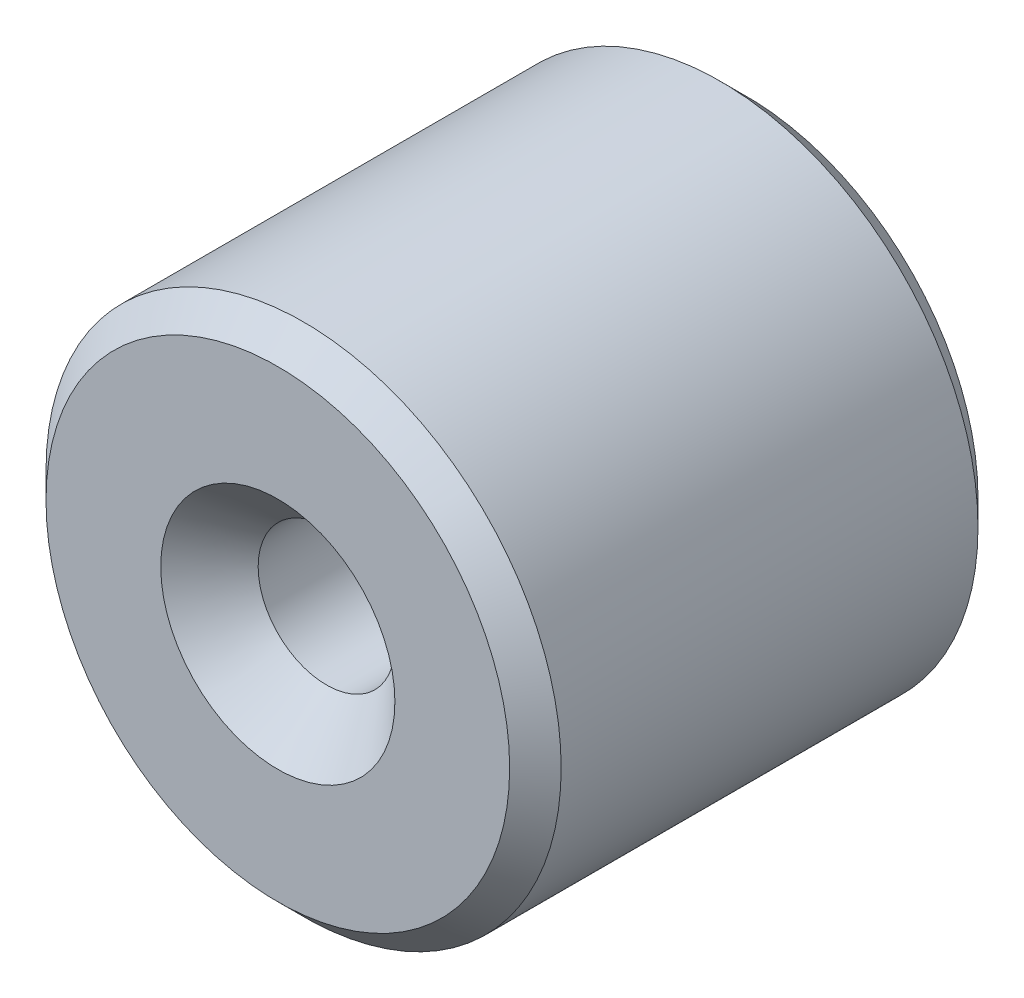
ISO-10303-21;
HEADER;
FILE_DESCRIPTION(('STEP AP214'),'2;1');
FILE_NAME('part.step','',(''),(''),'','','');
FILE_SCHEMA(('AUTOMOTIVE_DESIGN { 1 0 10303 214 1 1 1 1 }'));
ENDSEC;
DATA;
#1=APPLICATION_CONTEXT('core data for automotive mechanical design processes');
#2=APPLICATION_PROTOCOL_DEFINITION('international standard','automotive_design',2000,#1);
#3=PRODUCT_CONTEXT('',#1,'mechanical');
#4=PRODUCT('Part','Part','',(#3));
#5=PRODUCT_RELATED_PRODUCT_CATEGORY('part','',(#4));
#6=PRODUCT_DEFINITION_FORMATION('','',#4);
#7=PRODUCT_DEFINITION_CONTEXT('part definition',#1,'design');
#8=PRODUCT_DEFINITION('design','',#6,#7);
#9=PRODUCT_DEFINITION_SHAPE('','',#8);
#10=(LENGTH_UNIT() NAMED_UNIT(*) SI_UNIT(.MILLI.,.METRE.));
#11=(NAMED_UNIT(*) PLANE_ANGLE_UNIT() SI_UNIT($,.RADIAN.));
#12=(NAMED_UNIT(*) SI_UNIT($,.STERADIAN.) SOLID_ANGLE_UNIT());
#13=UNCERTAINTY_MEASURE_WITH_UNIT(LENGTH_MEASURE(1.E-05),#10,'distance_accuracy_value','');
#14=(GEOMETRIC_REPRESENTATION_CONTEXT(3) GLOBAL_UNCERTAINTY_ASSIGNED_CONTEXT((#13)) GLOBAL_UNIT_ASSIGNED_CONTEXT((#10,
#11,#12)) REPRESENTATION_CONTEXT('',''));
#15=CARTESIAN_POINT('',(0.,0.,0.));
#16=DIRECTION('',(0.,0.,1.));
#17=DIRECTION('',(1.,0.,0.));
#18=AXIS2_PLACEMENT_3D('',#15,#16,#17);
#19=CARTESIAN_POINT('',(0.,9.9,0.));
#20=DIRECTION('',(0.,0.,1.));
#21=DIRECTION('',(1.,0.,0.));
#22=AXIS2_PLACEMENT_3D('',#19,#20,#21);
#23=PLANE('',#22);
#24=CARTESIAN_POINT('',(0.,0.,0.));
#25=DIRECTION('',(0.,0.,-1.));
#26=DIRECTION('',(-1.,0.,0.));
#27=AXIS2_PLACEMENT_3D('',#24,#25,#26);
#28=CIRCLE('',#27,9.9);
#29=CARTESIAN_POINT('',(-9.9,0.,0.));
#30=VERTEX_POINT('',#29);
#31=EDGE_CURVE('E37',#30,#30,#28,.T.);
#32=ORIENTED_EDGE('',*,*,#31,.T.);
#33=EDGE_LOOP('',(#32));
#34=FACE_BOUND('',#33,.T.);
#35=CARTESIAN_POINT('',(0.,0.,0.));
#36=DIRECTION('',(0.,0.,-1.));
#37=DIRECTION('',(-1.,0.,0.));
#38=AXIS2_PLACEMENT_3D('',#35,#36,#37);
#39=CIRCLE('',#38,5.);
#40=CARTESIAN_POINT('',(-5.,0.,0.));
#41=VERTEX_POINT('',#40);
#42=EDGE_CURVE('E54',#41,#41,#39,.T.);
#43=ORIENTED_EDGE('',*,*,#42,.F.);
#44=EDGE_LOOP('',(#43));
#45=FACE_BOUND('',#44,.T.);
#46=ADVANCED_FACE('F13',(#34,#45),#23,.F.);
#47=CARTESIAN_POINT('',(0.,0.,20.));
#48=DIRECTION('',(0.,0.,-1.));
#49=DIRECTION('',(-1.,0.,0.));
#50=AXIS2_PLACEMENT_3D('',#47,#48,#49);
#51=PLANE('',#50);
#52=CARTESIAN_POINT('',(0.,0.,20.));
#53=DIRECTION('',(0.,0.,-1.));
#54=DIRECTION('',(-1.,0.,0.));
#55=AXIS2_PLACEMENT_3D('',#52,#53,#54);
#56=CIRCLE('',#55,9.9);
#57=CARTESIAN_POINT('',(-9.9,0.,20.));
#58=VERTEX_POINT('',#57);
#59=EDGE_CURVE('E8',#58,#58,#56,.T.);
#60=ORIENTED_EDGE('',*,*,#59,.F.);
#61=EDGE_LOOP('',(#60));
#62=FACE_BOUND('',#61,.T.);
#63=CARTESIAN_POINT('',(0.,0.,20.));
#64=DIRECTION('',(0.,0.,-1.));
#65=DIRECTION('',(-1.,0.,0.));
#66=AXIS2_PLACEMENT_3D('',#63,#64,#65);
#67=CIRCLE('',#66,5.);
#68=CARTESIAN_POINT('',(-5.,0.,20.));
#69=VERTEX_POINT('',#68);
#70=EDGE_CURVE('E43',#69,#69,#67,.T.);
#71=ORIENTED_EDGE('',*,*,#70,.T.);
#72=EDGE_LOOP('',(#71));
#73=FACE_BOUND('',#72,.T.);
#74=ADVANCED_FACE('F64',(#62,#73),#51,.F.);
#75=CARTESIAN_POINT('',(0.,0.,20.));
#76=DIRECTION('',(0.,0.,-1.));
#77=DIRECTION('',(-1.,0.,0.));
#78=AXIS2_PLACEMENT_3D('',#75,#76,#77);
#79=CONICAL_SURFACE('',#78,9.9,0.785398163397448);
#80=CARTESIAN_POINT('',(0.,0.,18.9));
#81=DIRECTION('',(0.,0.,-1.));
#82=DIRECTION('',(-1.,0.,0.));
#83=AXIS2_PLACEMENT_3D('',#80,#81,#82);
#84=CIRCLE('',#83,11.);
#85=CARTESIAN_POINT('',(-11.,0.,18.9));
#86=VERTEX_POINT('',#85);
#87=EDGE_CURVE('E20',#86,#86,#84,.T.);
#88=ORIENTED_EDGE('',*,*,#87,.F.);
#89=EDGE_LOOP('',(#88));
#90=FACE_BOUND('',#89,.T.);
#91=ORIENTED_EDGE('',*,*,#59,.T.);
#92=EDGE_LOOP('',(#91));
#93=FACE_BOUND('',#92,.T.);
#94=ADVANCED_FACE('F70',(#90,#93),#79,.T.);
#95=CARTESIAN_POINT('',(0.,0.,0.));
#96=DIRECTION('',(0.,0.,-1.));
#97=DIRECTION('',(-1.,0.,0.));
#98=AXIS2_PLACEMENT_3D('',#95,#96,#97);
#99=CYLINDRICAL_SURFACE('',#98,11.);
#100=CARTESIAN_POINT('',(0.,0.,1.1));
#101=DIRECTION('',(0.,0.,-1.));
#102=DIRECTION('',(-1.,0.,0.));
#103=AXIS2_PLACEMENT_3D('',#100,#101,#102);
#104=CIRCLE('',#103,11.);
#105=CARTESIAN_POINT('',(-11.,0.,1.1));
#106=VERTEX_POINT('',#105);
#107=EDGE_CURVE('E29',#106,#106,#104,.T.);
#108=ORIENTED_EDGE('',*,*,#107,.F.);
#109=EDGE_LOOP('',(#108));
#110=FACE_BOUND('',#109,.T.);
#111=ORIENTED_EDGE('',*,*,#87,.T.);
#112=EDGE_LOOP('',(#111));
#113=FACE_BOUND('',#112,.T.);
#114=ADVANCED_FACE('F78',(#110,#113),#99,.T.);
#115=CARTESIAN_POINT('',(0.,0.,1.1));
#116=DIRECTION('',(0.,0.,1.));
#117=DIRECTION('',(1.,0.,0.));
#118=AXIS2_PLACEMENT_3D('',#115,#116,#117);
#119=CONICAL_SURFACE('',#118,11.,0.785398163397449);
#120=ORIENTED_EDGE('',*,*,#31,.F.);
#121=EDGE_LOOP('',(#120));
#122=FACE_BOUND('',#121,.T.);
#123=ORIENTED_EDGE('',*,*,#107,.T.);
#124=EDGE_LOOP('',(#123));
#125=FACE_BOUND('',#124,.T.);
#126=ADVANCED_FACE('F74',(#122,#125),#119,.T.);
#127=CARTESIAN_POINT('',(0.,0.,20.));
#128=DIRECTION('',(0.,0.,1.));
#129=DIRECTION('',(1.,0.,0.));
#130=AXIS2_PLACEMENT_3D('',#127,#128,#129);
#131=CONICAL_SURFACE('',#130,5.,0.785398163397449);
#132=CARTESIAN_POINT('',(0.,0.,17.92));
#133=DIRECTION('',(0.,0.,-1.));
#134=DIRECTION('',(-1.,0.,0.));
#135=AXIS2_PLACEMENT_3D('',#132,#133,#134);
#136=CIRCLE('',#135,2.92);
#137=CARTESIAN_POINT('',(-2.92,0.,17.92));
#138=VERTEX_POINT('',#137);
#139=EDGE_CURVE('E46',#138,#138,#136,.T.);
#140=ORIENTED_EDGE('',*,*,#139,.T.);
#141=EDGE_LOOP('',(#140));
#142=FACE_BOUND('',#141,.T.);
#143=ORIENTED_EDGE('',*,*,#70,.F.);
#144=EDGE_LOOP('',(#143));
#145=FACE_BOUND('',#144,.T.);
#146=ADVANCED_FACE('F77',(#142,#145),#131,.F.);
#147=CARTESIAN_POINT('',(0.,0.,-1.));
#148=DIRECTION('',(0.,0.,-1.));
#149=DIRECTION('',(-1.,0.,0.));
#150=AXIS2_PLACEMENT_3D('',#147,#148,#149);
#151=CYLINDRICAL_SURFACE('',#150,2.92);
#152=CARTESIAN_POINT('',(0.,0.,2.08));
#153=DIRECTION('',(0.,0.,-1.));
#154=DIRECTION('',(-1.,0.,0.));
#155=AXIS2_PLACEMENT_3D('',#152,#153,#154);
#156=CIRCLE('',#155,2.92);
#157=CARTESIAN_POINT('',(-2.92,0.,2.08));
#158=VERTEX_POINT('',#157);
#159=EDGE_CURVE('E50',#158,#158,#156,.T.);
#160=ORIENTED_EDGE('',*,*,#159,.T.);
#161=EDGE_LOOP('',(#160));
#162=FACE_BOUND('',#161,.T.);
#163=ORIENTED_EDGE('',*,*,#139,.F.);
#164=EDGE_LOOP('',(#163));
#165=FACE_BOUND('',#164,.T.);
#166=ADVANCED_FACE('F92',(#162,#165),#151,.F.);
#167=CARTESIAN_POINT('',(0.,0.,2.08));
#168=DIRECTION('',(0.,0.,-1.));
#169=DIRECTION('',(-1.,0.,0.));
#170=AXIS2_PLACEMENT_3D('',#167,#168,#169);
#171=CONICAL_SURFACE('',#170,2.92,0.785398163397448);
#172=ORIENTED_EDGE('',*,*,#42,.T.);
#173=EDGE_LOOP('',(#172));
#174=FACE_BOUND('',#173,.T.);
#175=ORIENTED_EDGE('',*,*,#159,.F.);
#176=EDGE_LOOP('',(#175));
#177=FACE_BOUND('',#176,.T.);
#178=ADVANCED_FACE('F60',(#174,#177),#171,.F.);
#179=CLOSED_SHELL('',(#46,#74,#94,#114,#126,#146,#166,#178));
#180=MANIFOLD_SOLID_BREP('B1',#179);
#181=ADVANCED_BREP_SHAPE_REPRESENTATION('',(#18,#180),#14);
#182=SHAPE_DEFINITION_REPRESENTATION(#9,#181);
ENDSEC;
END-ISO-10303-21;
